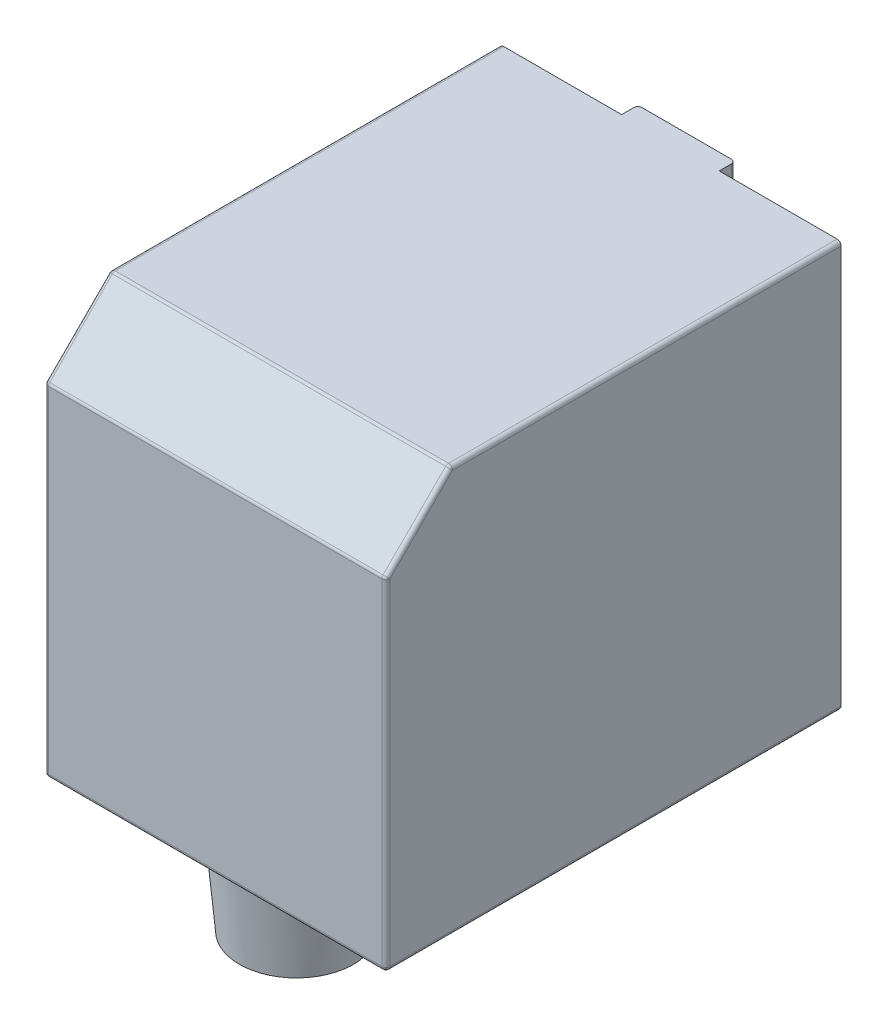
ISO-10303-21;
HEADER;
FILE_DESCRIPTION(('STEP AP214'),'2;1');
FILE_NAME('part.step','',(''),(''),'','','');
FILE_SCHEMA(('AUTOMOTIVE_DESIGN { 1 0 10303 214 1 1 1 1 }'));
ENDSEC;
DATA;
#1=APPLICATION_CONTEXT('core data for automotive mechanical design processes');
#2=APPLICATION_PROTOCOL_DEFINITION('international standard','automotive_design',2000,#1);
#3=PRODUCT_CONTEXT('',#1,'mechanical');
#4=PRODUCT('Part','Part','',(#3));
#5=PRODUCT_RELATED_PRODUCT_CATEGORY('part','',(#4));
#6=PRODUCT_DEFINITION_FORMATION('','',#4);
#7=PRODUCT_DEFINITION_CONTEXT('part definition',#1,'design');
#8=PRODUCT_DEFINITION('design','',#6,#7);
#9=PRODUCT_DEFINITION_SHAPE('','',#8);
#10=(LENGTH_UNIT() NAMED_UNIT(*) SI_UNIT(.MILLI.,.METRE.));
#11=(NAMED_UNIT(*) PLANE_ANGLE_UNIT() SI_UNIT($,.RADIAN.));
#12=(NAMED_UNIT(*) SI_UNIT($,.STERADIAN.) SOLID_ANGLE_UNIT());
#13=UNCERTAINTY_MEASURE_WITH_UNIT(LENGTH_MEASURE(1.E-05),#10,'distance_accuracy_value','');
#14=(GEOMETRIC_REPRESENTATION_CONTEXT(3) GLOBAL_UNCERTAINTY_ASSIGNED_CONTEXT((#13)) GLOBAL_UNIT_ASSIGNED_CONTEXT((#10,
#11,#12)) REPRESENTATION_CONTEXT('',''));
#15=CARTESIAN_POINT('',(0.,0.,0.));
#16=DIRECTION('',(0.,0.,1.));
#17=DIRECTION('',(1.,0.,0.));
#18=AXIS2_PLACEMENT_3D('',#15,#16,#17);
#19=CARTESIAN_POINT('',(0.,500.,0.));
#20=DIRECTION('',(0.,0.,-1.));
#21=DIRECTION('',(-1.,0.,0.));
#22=AXIS2_PLACEMENT_3D('',#19,#20,#21);
#23=PLANE('',#22);
#24=DIRECTION('',(1.,0.,0.));
#25=VECTOR('',#24,1.);
#26=CARTESIAN_POINT('',(0.,5.,0.));
#27=LINE('',#26,#25);
#28=CARTESIAN_POINT('',(420.,5.,0.));
#29=VERTEX_POINT('',#28);
#30=CARTESIAN_POINT('',(270.,5.,0.));
#31=VERTEX_POINT('',#30);
#32=EDGE_CURVE('E184',#29,#31,#27,.F.);
#33=ORIENTED_EDGE('',*,*,#32,.T.);
#34=DIRECTION('',(0.,-1.,0.));
#35=VECTOR('',#34,1.);
#36=CARTESIAN_POINT('',(270.,500.,0.));
#37=LINE('',#36,#35);
#38=CARTESIAN_POINT('',(270.,500.,0.));
#39=VERTEX_POINT('',#38);
#40=EDGE_CURVE('E195',#39,#31,#37,.T.);
#41=ORIENTED_EDGE('',*,*,#40,.F.);
#42=DIRECTION('',(-1.,0.,0.));
#43=VECTOR('',#42,1.);
#44=CARTESIAN_POINT('',(0.,500.,0.));
#45=LINE('',#44,#43);
#46=CARTESIAN_POINT('',(415.,500.,0.));
#47=VERTEX_POINT('',#46);
#48=EDGE_CURVE('E284',#47,#39,#45,.T.);
#49=ORIENTED_EDGE('',*,*,#48,.F.);
#50=CARTESIAN_POINT('',(415.,495.,0.));
#51=DIRECTION('',(0.,0.,-1.));
#52=DIRECTION('',(-1.,0.,0.));
#53=AXIS2_PLACEMENT_3D('',#50,#51,#52);
#54=CIRCLE('',#53,5.);
#55=CARTESIAN_POINT('',(420.,495.,0.));
#56=VERTEX_POINT('',#55);
#57=EDGE_CURVE('E185',#47,#56,#54,.T.);
#58=ORIENTED_EDGE('',*,*,#57,.T.);
#59=DIRECTION('',(0.,1.,0.));
#60=VECTOR('',#59,1.);
#61=CARTESIAN_POINT('',(420.,0.,0.));
#62=LINE('',#61,#60);
#63=EDGE_CURVE('E281',#29,#56,#62,.T.);
#64=ORIENTED_EDGE('',*,*,#63,.F.);
#65=EDGE_LOOP('',(#33,#41,#49,#58,#64));
#66=FACE_BOUND('',#65,.T.);
#67=ADVANCED_FACE('F27',(#66),#23,.T.);
#68=CARTESIAN_POINT('',(150.,500.,0.));
#69=VERTEX_POINT('',#68);
#70=CARTESIAN_POINT('',(5.,500.,0.));
#71=VERTEX_POINT('',#70);
#72=EDGE_CURVE('E190',#69,#71,#45,.T.);
#73=ORIENTED_EDGE('',*,*,#72,.F.);
#74=DIRECTION('',(0.,1.,0.));
#75=VECTOR('',#74,1.);
#76=CARTESIAN_POINT('',(150.,500.,0.));
#77=LINE('',#76,#75);
#78=CARTESIAN_POINT('',(150.,5.,0.));
#79=VERTEX_POINT('',#78);
#80=EDGE_CURVE('E162',#79,#69,#77,.T.);
#81=ORIENTED_EDGE('',*,*,#80,.F.);
#82=CARTESIAN_POINT('',(0.,5.,0.));
#83=VERTEX_POINT('',#82);
#84=EDGE_CURVE('E173',#79,#83,#27,.F.);
#85=ORIENTED_EDGE('',*,*,#84,.T.);
#86=DIRECTION('',(0.,-1.,0.));
#87=VECTOR('',#86,1.);
#88=CARTESIAN_POINT('',(0.,0.,0.));
#89=LINE('',#88,#87);
#90=CARTESIAN_POINT('',(0.,495.,0.));
#91=VERTEX_POINT('',#90);
#92=EDGE_CURVE('E279',#91,#83,#89,.T.);
#93=ORIENTED_EDGE('',*,*,#92,.F.);
#94=CARTESIAN_POINT('',(5.,495.,0.));
#95=DIRECTION('',(0.,0.,-1.));
#96=DIRECTION('',(-1.,0.,0.));
#97=AXIS2_PLACEMENT_3D('',#94,#95,#96);
#98=CIRCLE('',#97,5.);
#99=EDGE_CURVE('E308',#91,#71,#98,.T.);
#100=ORIENTED_EDGE('',*,*,#99,.T.);
#101=EDGE_LOOP('',(#73,#81,#85,#93,#100));
#102=FACE_BOUND('',#101,.T.);
#103=ADVANCED_FACE('F188',(#102),#23,.T.);
#104=CARTESIAN_POINT('',(210.,-110.,460.));
#105=DIRECTION('',(0.,-1.,0.));
#106=DIRECTION('',(0.,0.,-1.));
#107=AXIS2_PLACEMENT_3D('',#104,#105,#106);
#108=PLANE('',#107);
#109=CARTESIAN_POINT('',(210.,-110.,460.));
#110=DIRECTION('',(0.,-1.,0.));
#111=DIRECTION('',(0.,0.,-1.));
#112=AXIS2_PLACEMENT_3D('',#109,#110,#111);
#113=CIRCLE('',#112,70.3762470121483);
#114=CARTESIAN_POINT('',(210.,-110.,389.623752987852));
#115=VERTEX_POINT('',#114);
#116=EDGE_CURVE('E276',#115,#115,#113,.T.);
#117=ORIENTED_EDGE('',*,*,#116,.T.);
#118=EDGE_LOOP('',(#117));
#119=FACE_BOUND('',#118,.T.);
#120=CARTESIAN_POINT('',(210.,-110.,460.));
#121=DIRECTION('',(0.,-1.,0.));
#122=DIRECTION('',(0.,0.,-1.));
#123=AXIS2_PLACEMENT_3D('',#120,#121,#122);
#124=CIRCLE('',#123,42.5);
#125=CARTESIAN_POINT('',(210.,-110.,417.5));
#126=VERTEX_POINT('',#125);
#127=EDGE_CURVE('E270',#126,#126,#124,.T.);
#128=ORIENTED_EDGE('',*,*,#127,.F.);
#129=EDGE_LOOP('',(#128));
#130=FACE_BOUND('',#129,.T.);
#131=ADVANCED_FACE('F461',(#119,#130),#108,.T.);
#132=CARTESIAN_POINT('',(0.,0.,560.));
#133=DIRECTION('',(0.,1.,0.));
#134=DIRECTION('',(0.,0.,1.));
#135=AXIS2_PLACEMENT_3D('',#132,#133,#134);
#136=PLANE('',#135);
#137=DIRECTION('',(1.,0.,0.));
#138=VECTOR('',#137,1.);
#139=CARTESIAN_POINT('',(420.,0.,5.));
#140=LINE('',#139,#138);
#141=CARTESIAN_POINT('',(5.,0.,5.));
#142=VERTEX_POINT('',#141);
#143=CARTESIAN_POINT('',(415.,0.,5.));
#144=VERTEX_POINT('',#143);
#145=EDGE_CURVE('E303',#142,#144,#140,.T.);
#146=ORIENTED_EDGE('',*,*,#145,.T.);
#147=DIRECTION('',(0.,0.,-1.));
#148=VECTOR('',#147,1.);
#149=CARTESIAN_POINT('',(415.,0.,560.));
#150=LINE('',#149,#148);
#151=CARTESIAN_POINT('',(415.,0.,555.));
#152=VERTEX_POINT('',#151);
#153=EDGE_CURVE('E305',#144,#152,#150,.F.);
#154=ORIENTED_EDGE('',*,*,#153,.T.);
#155=DIRECTION('',(1.,0.,0.));
#156=VECTOR('',#155,1.);
#157=CARTESIAN_POINT('',(0.,0.,555.));
#158=LINE('',#157,#156);
#159=CARTESIAN_POINT('',(5.,0.,555.));
#160=VERTEX_POINT('',#159);
#161=EDGE_CURVE('E299',#152,#160,#158,.F.);
#162=ORIENTED_EDGE('',*,*,#161,.T.);
#163=DIRECTION('',(0.,0.,-1.));
#164=VECTOR('',#163,1.);
#165=CARTESIAN_POINT('',(5.,0.,560.));
#166=LINE('',#165,#164);
#167=EDGE_CURVE('E301',#160,#142,#166,.T.);
#168=ORIENTED_EDGE('',*,*,#167,.T.);
#169=EDGE_LOOP('',(#146,#154,#162,#168));
#170=FACE_BOUND('',#169,.T.);
#171=CARTESIAN_POINT('',(210.,0.,460.));
#172=DIRECTION('',(0.,1.,0.));
#173=DIRECTION('',(0.,0.,1.));
#174=AXIS2_PLACEMENT_3D('',#171,#172,#173);
#175=CIRCLE('',#174,80.);
#176=CARTESIAN_POINT('',(210.,0.,540.));
#177=VERTEX_POINT('',#176);
#178=EDGE_CURVE('E287',#177,#177,#175,.F.);
#179=ORIENTED_EDGE('',*,*,#178,.F.);
#180=EDGE_LOOP('',(#179));
#181=FACE_BOUND('',#180,.T.);
#182=ADVANCED_FACE('F398',(#170,#181),#136,.F.);
#183=CARTESIAN_POINT('',(0.,0.,560.));
#184=DIRECTION('',(1.,0.,0.));
#185=DIRECTION('',(0.,0.,-1.));
#186=AXIS2_PLACEMENT_3D('',#183,#184,#185);
#187=PLANE('',#186);
#188=ORIENTED_EDGE('',*,*,#92,.T.);
#189=DIRECTION('',(0.,0.,-1.));
#190=VECTOR('',#189,1.);
#191=CARTESIAN_POINT('',(0.,5.,560.));
#192=LINE('',#191,#190);
#193=CARTESIAN_POINT('',(0.,5.,555.));
#194=VERTEX_POINT('',#193);
#195=EDGE_CURVE('E317',#83,#194,#192,.F.);
#196=ORIENTED_EDGE('',*,*,#195,.T.);
#197=DIRECTION('',(0.,-1.,0.));
#198=VECTOR('',#197,1.);
#199=CARTESIAN_POINT('',(0.,0.,555.));
#200=LINE('',#199,#198);
#201=CARTESIAN_POINT('',(0.,417.928932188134,555.));
#202=VERTEX_POINT('',#201);
#203=EDGE_CURVE('E315',#194,#202,#200,.F.);
#204=ORIENTED_EDGE('',*,*,#203,.T.);
#205=DIRECTION('',(0.,-0.707106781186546,0.707106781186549));
#206=VECTOR('',#205,1.);
#207=CARTESIAN_POINT('',(0.,496.464466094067,476.464466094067));
#208=LINE('',#207,#206);
#209=CARTESIAN_POINT('',(0.,495.,477.928932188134));
#210=VERTEX_POINT('',#209);
#211=EDGE_CURVE('E313',#202,#210,#208,.F.);
#212=ORIENTED_EDGE('',*,*,#211,.T.);
#213=DIRECTION('',(0.,0.,-1.));
#214=VECTOR('',#213,1.);
#215=CARTESIAN_POINT('',(0.,495.,560.));
#216=LINE('',#215,#214);
#217=EDGE_CURVE('E311',#210,#91,#216,.T.);
#218=ORIENTED_EDGE('',*,*,#217,.T.);
#219=EDGE_LOOP('',(#188,#196,#204,#212,#218));
#220=FACE_BOUND('',#219,.T.);
#221=ADVANCED_FACE('F29',(#220),#187,.F.);
#222=CARTESIAN_POINT('',(420.,0.,560.));
#223=DIRECTION('',(-1.,0.,0.));
#224=DIRECTION('',(0.,0.,1.));
#225=AXIS2_PLACEMENT_3D('',#222,#223,#224);
#226=PLANE('',#225);
#227=DIRECTION('',(0.,1.,0.));
#228=VECTOR('',#227,1.);
#229=CARTESIAN_POINT('',(420.,0.,555.));
#230=LINE('',#229,#228);
#231=CARTESIAN_POINT('',(420.,417.928932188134,555.));
#232=VERTEX_POINT('',#231);
#233=CARTESIAN_POINT('',(420.,5.,555.));
#234=VERTEX_POINT('',#233);
#235=EDGE_CURVE('E294',#232,#234,#230,.F.);
#236=ORIENTED_EDGE('',*,*,#235,.T.);
#237=DIRECTION('',(0.,0.,-1.));
#238=VECTOR('',#237,1.);
#239=CARTESIAN_POINT('',(420.,5.,560.));
#240=LINE('',#239,#238);
#241=EDGE_CURVE('E296',#234,#29,#240,.T.);
#242=ORIENTED_EDGE('',*,*,#241,.T.);
#243=ORIENTED_EDGE('',*,*,#63,.T.);
#244=DIRECTION('',(0.,0.,-1.));
#245=VECTOR('',#244,1.);
#246=CARTESIAN_POINT('',(420.,495.,560.));
#247=LINE('',#246,#245);
#248=CARTESIAN_POINT('',(420.,495.,477.928932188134));
#249=VERTEX_POINT('',#248);
#250=EDGE_CURVE('E290',#56,#249,#247,.F.);
#251=ORIENTED_EDGE('',*,*,#250,.T.);
#252=DIRECTION('',(0.,0.707106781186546,-0.707106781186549));
#253=VECTOR('',#252,1.);
#254=CARTESIAN_POINT('',(420.,416.464466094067,556.464466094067));
#255=LINE('',#254,#253);
#256=EDGE_CURVE('E292',#249,#232,#255,.F.);
#257=ORIENTED_EDGE('',*,*,#256,.T.);
#258=EDGE_LOOP('',(#236,#242,#243,#251,#257));
#259=FACE_BOUND('',#258,.T.);
#260=ADVANCED_FACE('F388',(#259),#226,.F.);
#261=CARTESIAN_POINT('',(0.,500.,560.));
#262=DIRECTION('',(0.,-1.,0.));
#263=DIRECTION('',(0.,0.,-1.));
#264=AXIS2_PLACEMENT_3D('',#261,#262,#263);
#265=PLANE('',#264);
#266=DIRECTION('',(0.,0.,1.));
#267=VECTOR('',#266,1.);
#268=CARTESIAN_POINT('',(270.,500.,-20.));
#269=LINE('',#268,#267);
#270=CARTESIAN_POINT('',(270.,500.,-15.));
#271=VERTEX_POINT('',#270);
#272=EDGE_CURVE('E205',#271,#39,#269,.T.);
#273=ORIENTED_EDGE('',*,*,#272,.F.);
#274=CARTESIAN_POINT('',(265.,500.,-15.));
#275=DIRECTION('',(0.,-1.,0.));
#276=DIRECTION('',(0.,0.,-1.));
#277=AXIS2_PLACEMENT_3D('',#274,#275,#276);
#278=CIRCLE('',#277,5.);
#279=CARTESIAN_POINT('',(265.,500.,-20.));
#280=VERTEX_POINT('',#279);
#281=EDGE_CURVE('E35',#271,#280,#278,.F.);
#282=ORIENTED_EDGE('',*,*,#281,.T.);
#283=DIRECTION('',(1.,0.,0.));
#284=VECTOR('',#283,1.);
#285=CARTESIAN_POINT('',(270.,500.,-20.));
#286=LINE('',#285,#284);
#287=CARTESIAN_POINT('',(155.,500.,-20.));
#288=VERTEX_POINT('',#287);
#289=EDGE_CURVE('E202',#288,#280,#286,.T.);
#290=ORIENTED_EDGE('',*,*,#289,.F.);
#291=CARTESIAN_POINT('',(155.,500.,-15.));
#292=DIRECTION('',(0.,-1.,0.));
#293=DIRECTION('',(0.,0.,-1.));
#294=AXIS2_PLACEMENT_3D('',#291,#292,#293);
#295=CIRCLE('',#294,5.);
#296=CARTESIAN_POINT('',(150.,500.,-15.));
#297=VERTEX_POINT('',#296);
#298=EDGE_CURVE('E42',#288,#297,#295,.F.);
#299=ORIENTED_EDGE('',*,*,#298,.T.);
#300=DIRECTION('',(0.,0.,1.));
#301=VECTOR('',#300,1.);
#302=CARTESIAN_POINT('',(150.,500.,-20.));
#303=LINE('',#302,#301);
#304=EDGE_CURVE('E168',#297,#69,#303,.T.);
#305=ORIENTED_EDGE('',*,*,#304,.T.);
#306=ORIENTED_EDGE('',*,*,#72,.T.);
#307=DIRECTION('',(0.,0.,-1.));
#308=VECTOR('',#307,1.);
#309=CARTESIAN_POINT('',(5.,500.,560.));
#310=LINE('',#309,#308);
#311=CARTESIAN_POINT('',(5.,500.,477.928932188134));
#312=VERTEX_POINT('',#311);
#313=EDGE_CURVE('E337',#71,#312,#310,.F.);
#314=ORIENTED_EDGE('',*,*,#313,.T.);
#315=DIRECTION('',(-1.,0.,0.));
#316=VECTOR('',#315,1.);
#317=CARTESIAN_POINT('',(420.,500.,477.928932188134));
#318=LINE('',#317,#316);
#319=CARTESIAN_POINT('',(415.,500.,477.928932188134));
#320=VERTEX_POINT('',#319);
#321=EDGE_CURVE('E339',#312,#320,#318,.F.);
#322=ORIENTED_EDGE('',*,*,#321,.T.);
#323=DIRECTION('',(0.,0.,-1.));
#324=VECTOR('',#323,1.);
#325=CARTESIAN_POINT('',(415.,500.,560.));
#326=LINE('',#325,#324);
#327=EDGE_CURVE('E341',#320,#47,#326,.T.);
#328=ORIENTED_EDGE('',*,*,#327,.T.);
#329=ORIENTED_EDGE('',*,*,#48,.T.);
#330=EDGE_LOOP('',(#273,#282,#290,#299,#305,#306,#314,#322,#328,#329));
#331=FACE_BOUND('',#330,.T.);
#332=ADVANCED_FACE('F355',(#331),#265,.F.);
#333=CARTESIAN_POINT('',(0.,500.,560.));
#334=DIRECTION('',(0.,0.,-1.));
#335=DIRECTION('',(-1.,0.,0.));
#336=AXIS2_PLACEMENT_3D('',#333,#334,#335);
#337=PLANE('',#336);
#338=DIRECTION('',(0.,-1.,0.));
#339=VECTOR('',#338,1.);
#340=CARTESIAN_POINT('',(5.,500.,560.));
#341=LINE('',#340,#339);
#342=CARTESIAN_POINT('',(5.,417.928932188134,560.));
#343=VERTEX_POINT('',#342);
#344=CARTESIAN_POINT('',(5.,5.,560.));
#345=VERTEX_POINT('',#344);
#346=EDGE_CURVE('E321',#343,#345,#341,.T.);
#347=ORIENTED_EDGE('',*,*,#346,.T.);
#348=DIRECTION('',(1.,0.,0.));
#349=VECTOR('',#348,1.);
#350=CARTESIAN_POINT('',(0.,5.,560.));
#351=LINE('',#350,#349);
#352=CARTESIAN_POINT('',(415.,5.,560.));
#353=VERTEX_POINT('',#352);
#354=EDGE_CURVE('E325',#345,#353,#351,.T.);
#355=ORIENTED_EDGE('',*,*,#354,.T.);
#356=DIRECTION('',(0.,1.,0.));
#357=VECTOR('',#356,1.);
#358=CARTESIAN_POINT('',(415.,500.,560.));
#359=LINE('',#358,#357);
#360=CARTESIAN_POINT('',(415.,417.928932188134,560.));
#361=VERTEX_POINT('',#360);
#362=EDGE_CURVE('E323',#353,#361,#359,.T.);
#363=ORIENTED_EDGE('',*,*,#362,.T.);
#364=DIRECTION('',(1.,0.,0.));
#365=VECTOR('',#364,1.);
#366=CARTESIAN_POINT('',(0.,417.928932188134,560.));
#367=LINE('',#366,#365);
#368=EDGE_CURVE('E319',#361,#343,#367,.F.);
#369=ORIENTED_EDGE('',*,*,#368,.T.);
#370=EDGE_LOOP('',(#347,#355,#363,#369));
#371=FACE_BOUND('',#370,.T.);
#372=ADVANCED_FACE('F423',(#371),#337,.F.);
#373=CARTESIAN_POINT('',(0.,420.,560.));
#374=DIRECTION('',(0.,-0.707106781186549,-0.707106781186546));
#375=DIRECTION('',(0.,0.707106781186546,-0.707106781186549));
#376=AXIS2_PLACEMENT_3D('',#373,#374,#375);
#377=PLANE('',#376);
#378=DIRECTION('',(1.,0.,0.));
#379=VECTOR('',#378,1.);
#380=CARTESIAN_POINT('',(0.,498.535533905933,481.464466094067));
#381=LINE('',#380,#379);
#382=CARTESIAN_POINT('',(415.,498.535533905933,481.464466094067));
#383=VERTEX_POINT('',#382);
#384=CARTESIAN_POINT('',(5.,498.535533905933,481.464466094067));
#385=VERTEX_POINT('',#384);
#386=EDGE_CURVE('E328',#383,#385,#381,.F.);
#387=ORIENTED_EDGE('',*,*,#386,.T.);
#388=DIRECTION('',(0.,0.707106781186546,-0.707106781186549));
#389=VECTOR('',#388,1.);
#390=CARTESIAN_POINT('',(5.,420.,560.));
#391=LINE('',#390,#389);
#392=CARTESIAN_POINT('',(5.,421.464466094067,558.535533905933));
#393=VERTEX_POINT('',#392);
#394=EDGE_CURVE('E334',#385,#393,#391,.F.);
#395=ORIENTED_EDGE('',*,*,#394,.T.);
#396=DIRECTION('',(-1.,0.,0.));
#397=VECTOR('',#396,1.);
#398=CARTESIAN_POINT('',(420.,421.464466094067,558.535533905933));
#399=LINE('',#398,#397);
#400=CARTESIAN_POINT('',(415.,421.464466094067,558.535533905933));
#401=VERTEX_POINT('',#400);
#402=EDGE_CURVE('E332',#393,#401,#399,.F.);
#403=ORIENTED_EDGE('',*,*,#402,.T.);
#404=DIRECTION('',(0.,-0.707106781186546,0.707106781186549));
#405=VECTOR('',#404,1.);
#406=CARTESIAN_POINT('',(415.,500.,480.));
#407=LINE('',#406,#405);
#408=EDGE_CURVE('E330',#401,#383,#407,.F.);
#409=ORIENTED_EDGE('',*,*,#408,.T.);
#410=EDGE_LOOP('',(#387,#395,#403,#409));
#411=FACE_BOUND('',#410,.T.);
#412=ADVANCED_FACE('F436',(#411),#377,.F.);
#413=CARTESIAN_POINT('',(210.,0.,460.));
#414=DIRECTION('',(0.,1.,0.));
#415=DIRECTION('',(0.,0.,-1.));
#416=AXIS2_PLACEMENT_3D('',#413,#414,#415);
#417=CONICAL_SURFACE('',#416,80.,0.0872664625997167);
#418=ORIENTED_EDGE('',*,*,#116,.F.);
#419=EDGE_LOOP('',(#418));
#420=FACE_BOUND('',#419,.T.);
#421=ORIENTED_EDGE('',*,*,#178,.T.);
#422=EDGE_LOOP('',(#421));
#423=FACE_BOUND('',#422,.T.);
#424=ADVANCED_FACE('F485',(#420,#423),#417,.T.);
#425=CARTESIAN_POINT('',(210.,-120.,460.));
#426=DIRECTION('',(0.,1.,0.));
#427=DIRECTION('',(0.,0.,1.));
#428=AXIS2_PLACEMENT_3D('',#425,#426,#427);
#429=CYLINDRICAL_SURFACE('',#428,42.5);
#430=CARTESIAN_POINT('',(210.,-120.,460.));
#431=DIRECTION('',(0.,-1.,0.));
#432=DIRECTION('',(0.,0.,-1.));
#433=AXIS2_PLACEMENT_3D('',#430,#431,#432);
#434=CIRCLE('',#433,42.5);
#435=CARTESIAN_POINT('',(210.,-120.,417.5));
#436=VERTEX_POINT('',#435);
#437=EDGE_CURVE('E273',#436,#436,#434,.T.);
#438=ORIENTED_EDGE('',*,*,#437,.F.);
#439=EDGE_LOOP('',(#438));
#440=FACE_BOUND('',#439,.T.);
#441=ORIENTED_EDGE('',*,*,#127,.T.);
#442=EDGE_LOOP('',(#441));
#443=FACE_BOUND('',#442,.T.);
#444=ADVANCED_FACE('F483',(#440,#443),#429,.T.);
#445=CARTESIAN_POINT('',(210.,-120.,460.));
#446=DIRECTION('',(0.,-1.,0.));
#447=DIRECTION('',(0.,0.,-1.));
#448=AXIS2_PLACEMENT_3D('',#445,#446,#447);
#449=PLANE('',#448);
#450=CARTESIAN_POINT('',(210.,-120.,460.));
#451=DIRECTION('',(0.,-1.,0.));
#452=DIRECTION('',(0.,0.,-1.));
#453=AXIS2_PLACEMENT_3D('',#450,#451,#452);
#454=CIRCLE('',#453,22.5);
#455=CARTESIAN_POINT('',(210.,-120.,437.5));
#456=VERTEX_POINT('',#455);
#457=EDGE_CURVE('E209',#456,#456,#454,.T.);
#458=ORIENTED_EDGE('',*,*,#457,.F.);
#459=EDGE_LOOP('',(#458));
#460=FACE_BOUND('',#459,.T.);
#461=ORIENTED_EDGE('',*,*,#437,.T.);
#462=EDGE_LOOP('',(#461));
#463=FACE_BOUND('',#462,.T.);
#464=ADVANCED_FACE('F489',(#460,#463),#449,.T.);
#465=CARTESIAN_POINT('',(5.,495.,560.));
#466=DIRECTION('',(0.,0.,-1.));
#467=DIRECTION('',(-1.,0.,0.));
#468=AXIS2_PLACEMENT_3D('',#465,#466,#467);
#469=CYLINDRICAL_SURFACE('',#468,5.);
#470=CARTESIAN_POINT('',(5.,495.,477.928932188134));
#471=DIRECTION('',(0.,0.,1.));
#472=DIRECTION('',(1.,0.,0.));
#473=AXIS2_PLACEMENT_3D('',#470,#471,#472);
#474=CIRCLE('',#473,5.);
#475=EDGE_CURVE('E267',#312,#210,#474,.T.);
#476=ORIENTED_EDGE('',*,*,#475,.F.);
#477=ORIENTED_EDGE('',*,*,#313,.F.);
#478=ORIENTED_EDGE('',*,*,#99,.F.);
#479=ORIENTED_EDGE('',*,*,#217,.F.);
#480=EDGE_LOOP('',(#476,#477,#478,#479));
#481=FACE_BOUND('',#480,.T.);
#482=ADVANCED_FACE('F445',(#481),#469,.T.);
#483=CARTESIAN_POINT('',(5.,495.,477.928932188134));
#484=DIRECTION('',(0.,0.,1.));
#485=DIRECTION('',(1.,0.,0.));
#486=AXIS2_PLACEMENT_3D('',#483,#484,#485);
#487=SPHERICAL_SURFACE('',#486,5.);
#488=CARTESIAN_POINT('',(5.,495.,477.928932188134));
#489=DIRECTION('',(0.,0.707106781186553,-0.707106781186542));
#490=DIRECTION('',(0.,0.707106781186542,0.707106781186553));
#491=AXIS2_PLACEMENT_3D('',#488,#489,#490);
#492=CIRCLE('',#491,5.);
#493=EDGE_CURVE('E261',#385,#210,#492,.F.);
#494=ORIENTED_EDGE('',*,*,#493,.F.);
#495=CARTESIAN_POINT('',(5.,495.,477.928932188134));
#496=DIRECTION('',(-1.,0.,0.));
#497=DIRECTION('',(0.,0.,1.));
#498=AXIS2_PLACEMENT_3D('',#495,#496,#497);
#499=CIRCLE('',#498,5.);
#500=EDGE_CURVE('E264',#312,#385,#499,.F.);
#501=ORIENTED_EDGE('',*,*,#500,.F.);
#502=ORIENTED_EDGE('',*,*,#475,.T.);
#503=EDGE_LOOP('',(#494,#501,#502));
#504=FACE_BOUND('',#503,.T.);
#505=ADVANCED_FACE('F440',(#504),#487,.T.);
#506=CARTESIAN_POINT('',(0.,495.,477.928932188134));
#507=DIRECTION('',(1.,0.,0.));
#508=DIRECTION('',(0.,0.,-1.));
#509=AXIS2_PLACEMENT_3D('',#506,#507,#508);
#510=CYLINDRICAL_SURFACE('',#509,5.);
#511=ORIENTED_EDGE('',*,*,#500,.T.);
#512=ORIENTED_EDGE('',*,*,#386,.F.);
#513=CARTESIAN_POINT('',(415.,495.,477.928932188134));
#514=DIRECTION('',(1.,0.,0.));
#515=DIRECTION('',(0.,0.,-1.));
#516=AXIS2_PLACEMENT_3D('',#513,#514,#515);
#517=CIRCLE('',#516,5.);
#518=EDGE_CURVE('E258',#320,#383,#517,.T.);
#519=ORIENTED_EDGE('',*,*,#518,.F.);
#520=ORIENTED_EDGE('',*,*,#321,.F.);
#521=EDGE_LOOP('',(#511,#512,#519,#520));
#522=FACE_BOUND('',#521,.T.);
#523=ADVANCED_FACE('F378',(#522),#510,.T.);
#524=CARTESIAN_POINT('',(415.,495.,560.));
#525=DIRECTION('',(0.,0.,-1.));
#526=DIRECTION('',(-1.,0.,0.));
#527=AXIS2_PLACEMENT_3D('',#524,#525,#526);
#528=CYLINDRICAL_SURFACE('',#527,5.);
#529=ORIENTED_EDGE('',*,*,#57,.F.);
#530=ORIENTED_EDGE('',*,*,#327,.F.);
#531=CARTESIAN_POINT('',(415.,495.,477.928932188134));
#532=DIRECTION('',(0.,0.,1.));
#533=DIRECTION('',(0.,-1.,0.));
#534=AXIS2_PLACEMENT_3D('',#531,#532,#533);
#535=CIRCLE('',#534,5.);
#536=EDGE_CURVE('E255',#249,#320,#535,.T.);
#537=ORIENTED_EDGE('',*,*,#536,.F.);
#538=ORIENTED_EDGE('',*,*,#250,.F.);
#539=EDGE_LOOP('',(#529,#530,#537,#538));
#540=FACE_BOUND('',#539,.T.);
#541=ADVANCED_FACE('F373',(#540),#528,.T.);
#542=CARTESIAN_POINT('',(5.,206.464466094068,766.464466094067));
#543=DIRECTION('',(0.,0.707106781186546,-0.707106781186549));
#544=DIRECTION('',(0.,0.707106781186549,0.707106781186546));
#545=AXIS2_PLACEMENT_3D('',#542,#543,#544);
#546=CYLINDRICAL_SURFACE('',#545,5.);
#547=ORIENTED_EDGE('',*,*,#493,.T.);
#548=ORIENTED_EDGE('',*,*,#211,.F.);
#549=CARTESIAN_POINT('',(5.,417.928932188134,555.));
#550=DIRECTION('',(0.,-0.707106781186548,0.707106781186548));
#551=DIRECTION('',(0.,-0.707106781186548,-0.707106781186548));
#552=AXIS2_PLACEMENT_3D('',#549,#550,#551);
#553=CIRCLE('',#552,5.);
#554=EDGE_CURVE('E252',#393,#202,#553,.T.);
#555=ORIENTED_EDGE('',*,*,#554,.F.);
#556=ORIENTED_EDGE('',*,*,#394,.F.);
#557=EDGE_LOOP('',(#547,#548,#555,#556));
#558=FACE_BOUND('',#557,.T.);
#559=ADVANCED_FACE('F434',(#558),#546,.T.);
#560=CARTESIAN_POINT('',(415.,495.,477.928932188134));
#561=DIRECTION('',(0.,0.,1.));
#562=DIRECTION('',(1.,0.,0.));
#563=AXIS2_PLACEMENT_3D('',#560,#561,#562);
#564=SPHERICAL_SURFACE('',#563,5.);
#565=ORIENTED_EDGE('',*,*,#536,.T.);
#566=ORIENTED_EDGE('',*,*,#518,.T.);
#567=CARTESIAN_POINT('',(415.,495.,477.928932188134));
#568=DIRECTION('',(0.,0.707106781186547,-0.707106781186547));
#569=DIRECTION('',(0.,0.707106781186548,0.707106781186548));
#570=AXIS2_PLACEMENT_3D('',#567,#568,#569);
#571=CIRCLE('',#570,5.);
#572=EDGE_CURVE('E246',#249,#383,#571,.F.);
#573=ORIENTED_EDGE('',*,*,#572,.F.);
#574=EDGE_LOOP('',(#565,#566,#573));
#575=FACE_BOUND('',#574,.T.);
#576=ADVANCED_FACE('F380',(#575),#564,.T.);
#577=CARTESIAN_POINT('',(5.,417.928932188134,555.));
#578=DIRECTION('',(0.,0.,1.));
#579=DIRECTION('',(1.,0.,0.));
#580=AXIS2_PLACEMENT_3D('',#577,#578,#579);
#581=SPHERICAL_SURFACE('',#580,5.);
#582=CARTESIAN_POINT('',(5.,417.928932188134,555.));
#583=DIRECTION('',(0.,1.,0.));
#584=DIRECTION('',(0.,0.,1.));
#585=AXIS2_PLACEMENT_3D('',#582,#583,#584);
#586=CIRCLE('',#585,5.);
#587=EDGE_CURVE('E243',#343,#202,#586,.F.);
#588=ORIENTED_EDGE('',*,*,#587,.F.);
#589=CARTESIAN_POINT('',(5.,417.928932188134,555.));
#590=DIRECTION('',(-1.,0.,0.));
#591=DIRECTION('',(0.,0.,1.));
#592=AXIS2_PLACEMENT_3D('',#589,#590,#591);
#593=CIRCLE('',#592,5.);
#594=EDGE_CURVE('E249',#393,#343,#593,.F.);
#595=ORIENTED_EDGE('',*,*,#594,.F.);
#596=ORIENTED_EDGE('',*,*,#554,.T.);
#597=EDGE_LOOP('',(#588,#595,#596));
#598=FACE_BOUND('',#597,.T.);
#599=ADVANCED_FACE('F431',(#598),#581,.T.);
#600=CARTESIAN_POINT('',(0.,417.928932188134,555.));
#601=DIRECTION('',(-1.,0.,0.));
#602=DIRECTION('',(0.,0.,1.));
#603=AXIS2_PLACEMENT_3D('',#600,#601,#602);
#604=CYLINDRICAL_SURFACE('',#603,5.);
#605=ORIENTED_EDGE('',*,*,#594,.T.);
#606=ORIENTED_EDGE('',*,*,#368,.F.);
#607=CARTESIAN_POINT('',(415.,417.928932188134,555.));
#608=DIRECTION('',(1.,0.,0.));
#609=DIRECTION('',(0.,0.,-1.));
#610=AXIS2_PLACEMENT_3D('',#607,#608,#609);
#611=CIRCLE('',#610,5.);
#612=EDGE_CURVE('E240',#401,#361,#611,.T.);
#613=ORIENTED_EDGE('',*,*,#612,.F.);
#614=ORIENTED_EDGE('',*,*,#402,.F.);
#615=EDGE_LOOP('',(#605,#606,#613,#614));
#616=FACE_BOUND('',#615,.T.);
#617=ADVANCED_FACE('F428',(#616),#604,.T.);
#618=CARTESIAN_POINT('',(415.,206.464466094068,766.464466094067));
#619=DIRECTION('',(0.,-0.707106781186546,0.707106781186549));
#620=DIRECTION('',(0.,-0.707106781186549,-0.707106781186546));
#621=AXIS2_PLACEMENT_3D('',#618,#619,#620);
#622=CYLINDRICAL_SURFACE('',#621,5.);
#623=ORIENTED_EDGE('',*,*,#572,.T.);
#624=ORIENTED_EDGE('',*,*,#408,.F.);
#625=CARTESIAN_POINT('',(415.,417.928932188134,555.));
#626=DIRECTION('',(0.,-0.707106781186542,0.707106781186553));
#627=DIRECTION('',(0.,-0.707106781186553,-0.707106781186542));
#628=AXIS2_PLACEMENT_3D('',#625,#626,#627);
#629=CIRCLE('',#628,5.);
#630=EDGE_CURVE('E237',#232,#401,#629,.T.);
#631=ORIENTED_EDGE('',*,*,#630,.F.);
#632=ORIENTED_EDGE('',*,*,#256,.F.);
#633=EDGE_LOOP('',(#623,#624,#631,#632));
#634=FACE_BOUND('',#633,.T.);
#635=ADVANCED_FACE('F385',(#634),#622,.T.);
#636=CARTESIAN_POINT('',(5.,500.,555.));
#637=DIRECTION('',(0.,-1.,0.));
#638=DIRECTION('',(0.,0.,-1.));
#639=AXIS2_PLACEMENT_3D('',#636,#637,#638);
#640=CYLINDRICAL_SURFACE('',#639,5.);
#641=ORIENTED_EDGE('',*,*,#587,.T.);
#642=ORIENTED_EDGE('',*,*,#203,.F.);
#643=CARTESIAN_POINT('',(5.,5.,555.));
#644=DIRECTION('',(0.,-1.,0.));
#645=DIRECTION('',(1.,0.,0.));
#646=AXIS2_PLACEMENT_3D('',#643,#644,#645);
#647=CIRCLE('',#646,5.);
#648=EDGE_CURVE('E234',#345,#194,#647,.T.);
#649=ORIENTED_EDGE('',*,*,#648,.F.);
#650=ORIENTED_EDGE('',*,*,#346,.F.);
#651=EDGE_LOOP('',(#641,#642,#649,#650));
#652=FACE_BOUND('',#651,.T.);
#653=ADVANCED_FACE('F411',(#652),#640,.T.);
#654=CARTESIAN_POINT('',(415.,417.928932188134,555.));
#655=DIRECTION('',(0.,0.,1.));
#656=DIRECTION('',(1.,0.,0.));
#657=AXIS2_PLACEMENT_3D('',#654,#655,#656);
#658=SPHERICAL_SURFACE('',#657,5.);
#659=ORIENTED_EDGE('',*,*,#630,.T.);
#660=ORIENTED_EDGE('',*,*,#612,.T.);
#661=CARTESIAN_POINT('',(415.,417.928932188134,555.));
#662=DIRECTION('',(0.,1.,0.));
#663=DIRECTION('',(-1.,0.,0.));
#664=AXIS2_PLACEMENT_3D('',#661,#662,#663);
#665=CIRCLE('',#664,5.);
#666=EDGE_CURVE('E228',#232,#361,#665,.F.);
#667=ORIENTED_EDGE('',*,*,#666,.F.);
#668=EDGE_LOOP('',(#659,#660,#667));
#669=FACE_BOUND('',#668,.T.);
#670=ADVANCED_FACE('F560',(#669),#658,.T.);
#671=CARTESIAN_POINT('',(5.,5.,555.));
#672=DIRECTION('',(0.,0.,1.));
#673=DIRECTION('',(1.,0.,0.));
#674=AXIS2_PLACEMENT_3D('',#671,#672,#673);
#675=SPHERICAL_SURFACE('',#674,5.);
#676=CARTESIAN_POINT('',(5.,5.,555.));
#677=DIRECTION('',(0.,0.,1.));
#678=DIRECTION('',(1.,0.,0.));
#679=AXIS2_PLACEMENT_3D('',#676,#677,#678);
#680=CIRCLE('',#679,5.);
#681=EDGE_CURVE('E225',#160,#194,#680,.F.);
#682=ORIENTED_EDGE('',*,*,#681,.F.);
#683=CARTESIAN_POINT('',(5.,5.,555.));
#684=DIRECTION('',(-1.,0.,0.));
#685=DIRECTION('',(0.,0.,1.));
#686=AXIS2_PLACEMENT_3D('',#683,#684,#685);
#687=CIRCLE('',#686,5.);
#688=EDGE_CURVE('E231',#345,#160,#687,.F.);
#689=ORIENTED_EDGE('',*,*,#688,.F.);
#690=ORIENTED_EDGE('',*,*,#648,.T.);
#691=EDGE_LOOP('',(#682,#689,#690));
#692=FACE_BOUND('',#691,.T.);
#693=ADVANCED_FACE('F416',(#692),#675,.T.);
#694=CARTESIAN_POINT('',(0.,5.,555.));
#695=DIRECTION('',(1.,0.,0.));
#696=DIRECTION('',(0.,0.,-1.));
#697=AXIS2_PLACEMENT_3D('',#694,#695,#696);
#698=CYLINDRICAL_SURFACE('',#697,5.);
#699=ORIENTED_EDGE('',*,*,#688,.T.);
#700=ORIENTED_EDGE('',*,*,#161,.F.);
#701=CARTESIAN_POINT('',(415.,5.,555.));
#702=DIRECTION('',(1.,0.,0.));
#703=DIRECTION('',(0.,0.,-1.));
#704=AXIS2_PLACEMENT_3D('',#701,#702,#703);
#705=CIRCLE('',#704,5.);
#706=EDGE_CURVE('E222',#353,#152,#705,.T.);
#707=ORIENTED_EDGE('',*,*,#706,.F.);
#708=ORIENTED_EDGE('',*,*,#354,.F.);
#709=EDGE_LOOP('',(#699,#700,#707,#708));
#710=FACE_BOUND('',#709,.T.);
#711=ADVANCED_FACE('F420',(#710),#698,.T.);
#712=CARTESIAN_POINT('',(415.,500.,555.));
#713=DIRECTION('',(0.,1.,0.));
#714=DIRECTION('',(0.,0.,1.));
#715=AXIS2_PLACEMENT_3D('',#712,#713,#714);
#716=CYLINDRICAL_SURFACE('',#715,5.);
#717=ORIENTED_EDGE('',*,*,#666,.T.);
#718=ORIENTED_EDGE('',*,*,#362,.F.);
#719=CARTESIAN_POINT('',(415.,5.,555.));
#720=DIRECTION('',(0.,-1.,0.));
#721=DIRECTION('',(0.,0.,-1.));
#722=AXIS2_PLACEMENT_3D('',#719,#720,#721);
#723=CIRCLE('',#722,5.);
#724=EDGE_CURVE('E220',#234,#353,#723,.T.);
#725=ORIENTED_EDGE('',*,*,#724,.F.);
#726=ORIENTED_EDGE('',*,*,#235,.F.);
#727=EDGE_LOOP('',(#717,#718,#725,#726));
#728=FACE_BOUND('',#727,.T.);
#729=ADVANCED_FACE('F580',(#728),#716,.T.);
#730=CARTESIAN_POINT('',(5.,5.,560.));
#731=DIRECTION('',(0.,0.,-1.));
#732=DIRECTION('',(-1.,0.,0.));
#733=AXIS2_PLACEMENT_3D('',#730,#731,#732);
#734=CYLINDRICAL_SURFACE('',#733,5.);
#735=ORIENTED_EDGE('',*,*,#681,.T.);
#736=ORIENTED_EDGE('',*,*,#195,.F.);
#737=CARTESIAN_POINT('',(5.,5.,5.));
#738=DIRECTION('',(0.707106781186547,0.,-0.707106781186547));
#739=DIRECTION('',(-0.707106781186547,0.,-0.707106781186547));
#740=AXIS2_PLACEMENT_3D('',#737,#738,#739);
#741=ELLIPSE('',#740,7.07106781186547,5.);
#742=EDGE_CURVE('E180',#142,#83,#741,.T.);
#743=ORIENTED_EDGE('',*,*,#742,.F.);
#744=ORIENTED_EDGE('',*,*,#167,.F.);
#745=EDGE_LOOP('',(#735,#736,#743,#744));
#746=FACE_BOUND('',#745,.T.);
#747=ADVANCED_FACE('F404',(#746),#734,.T.);
#748=CARTESIAN_POINT('',(415.,5.,555.));
#749=DIRECTION('',(0.,0.,1.));
#750=DIRECTION('',(1.,0.,0.));
#751=AXIS2_PLACEMENT_3D('',#748,#749,#750);
#752=SPHERICAL_SURFACE('',#751,5.);
#753=ORIENTED_EDGE('',*,*,#724,.T.);
#754=ORIENTED_EDGE('',*,*,#706,.T.);
#755=CARTESIAN_POINT('',(415.,5.,555.));
#756=DIRECTION('',(0.,0.,1.));
#757=DIRECTION('',(1.,0.,0.));
#758=AXIS2_PLACEMENT_3D('',#755,#756,#757);
#759=CIRCLE('',#758,5.);
#760=EDGE_CURVE('E217',#234,#152,#759,.F.);
#761=ORIENTED_EDGE('',*,*,#760,.F.);
#762=EDGE_LOOP('',(#753,#754,#761));
#763=FACE_BOUND('',#762,.T.);
#764=ADVANCED_FACE('F594',(#763),#752,.T.);
#765=CARTESIAN_POINT('',(0.,5.,5.));
#766=DIRECTION('',(-1.,0.,0.));
#767=DIRECTION('',(0.,0.,1.));
#768=AXIS2_PLACEMENT_3D('',#765,#766,#767);
#769=CYLINDRICAL_SURFACE('',#768,5.);
#770=ORIENTED_EDGE('',*,*,#742,.T.);
#771=ORIENTED_EDGE('',*,*,#84,.F.);
#772=DIRECTION('',(-1.,0.,0.));
#773=VECTOR('',#772,1.);
#774=CARTESIAN_POINT('',(270.,5.,0.));
#775=LINE('',#774,#773);
#776=EDGE_CURVE('E176',#31,#79,#775,.T.);
#777=ORIENTED_EDGE('',*,*,#776,.F.);
#778=ORIENTED_EDGE('',*,*,#32,.F.);
#779=CARTESIAN_POINT('',(415.,5.,5.));
#780=DIRECTION('',(-0.707106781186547,0.,-0.707106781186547));
#781=DIRECTION('',(-0.707106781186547,0.,0.707106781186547));
#782=AXIS2_PLACEMENT_3D('',#779,#780,#781);
#783=ELLIPSE('',#782,7.07106781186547,5.);
#784=EDGE_CURVE('E215',#144,#29,#783,.F.);
#785=ORIENTED_EDGE('',*,*,#784,.F.);
#786=ORIENTED_EDGE('',*,*,#145,.F.);
#787=EDGE_LOOP('',(#770,#771,#777,#778,#785,#786));
#788=FACE_BOUND('',#787,.T.);
#789=ADVANCED_FACE('F174',(#788),#769,.T.);
#790=CARTESIAN_POINT('',(415.,5.,560.));
#791=DIRECTION('',(0.,0.,-1.));
#792=DIRECTION('',(-1.,0.,0.));
#793=AXIS2_PLACEMENT_3D('',#790,#791,#792);
#794=CYLINDRICAL_SURFACE('',#793,5.);
#795=ORIENTED_EDGE('',*,*,#760,.T.);
#796=ORIENTED_EDGE('',*,*,#153,.F.);
#797=ORIENTED_EDGE('',*,*,#784,.T.);
#798=ORIENTED_EDGE('',*,*,#241,.F.);
#799=EDGE_LOOP('',(#795,#796,#797,#798));
#800=FACE_BOUND('',#799,.T.);
#801=ADVANCED_FACE('F393',(#800),#794,.T.);
#802=CARTESIAN_POINT('',(210.,-120.,460.));
#803=DIRECTION('',(0.,-1.,0.));
#804=DIRECTION('',(0.,0.,-1.));
#805=AXIS2_PLACEMENT_3D('',#802,#803,#804);
#806=CONICAL_SURFACE('',#805,22.5,0.05235987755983);
#807=CARTESIAN_POINT('',(210.,0.,460.));
#808=DIRECTION('',(0.,-1.,0.));
#809=DIRECTION('',(0.,0.,-1.));
#810=AXIS2_PLACEMENT_3D('',#807,#808,#809);
#811=CIRCLE('',#810,16.211066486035);
#812=CARTESIAN_POINT('',(210.,0.,443.788933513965));
#813=VERTEX_POINT('',#812);
#814=EDGE_CURVE('E212',#813,#813,#811,.T.);
#815=ORIENTED_EDGE('',*,*,#814,.F.);
#816=EDGE_LOOP('',(#815));
#817=FACE_BOUND('',#816,.T.);
#818=ORIENTED_EDGE('',*,*,#457,.T.);
#819=EDGE_LOOP('',(#818));
#820=FACE_BOUND('',#819,.T.);
#821=ADVANCED_FACE('F609',(#817,#820),#806,.F.);
#822=CARTESIAN_POINT('',(210.,0.,460.));
#823=DIRECTION('',(0.,-1.,0.));
#824=DIRECTION('',(0.,0.,-1.));
#825=AXIS2_PLACEMENT_3D('',#822,#823,#824);
#826=PLANE('',#825);
#827=ORIENTED_EDGE('',*,*,#814,.T.);
#828=EDGE_LOOP('',(#827));
#829=FACE_BOUND('',#828,.T.);
#830=ADVANCED_FACE('F621',(#829),#826,.T.);
#831=CARTESIAN_POINT('',(270.,500.,-20.));
#832=DIRECTION('',(-1.,0.,0.));
#833=DIRECTION('',(0.,-1.,0.));
#834=AXIS2_PLACEMENT_3D('',#831,#832,#833);
#835=PLANE('',#834);
#836=DIRECTION('',(0.,0.,1.));
#837=VECTOR('',#836,1.);
#838=CARTESIAN_POINT('',(270.,5.,-20.));
#839=LINE('',#838,#837);
#840=CARTESIAN_POINT('',(270.,5.,-15.));
#841=VERTEX_POINT('',#840);
#842=EDGE_CURVE('E167',#841,#31,#839,.T.);
#843=ORIENTED_EDGE('',*,*,#842,.F.);
#844=DIRECTION('',(0.,-1.,0.));
#845=VECTOR('',#844,1.);
#846=CARTESIAN_POINT('',(270.,500.,-15.));
#847=LINE('',#846,#845);
#848=EDGE_CURVE('E50',#841,#271,#847,.F.);
#849=ORIENTED_EDGE('',*,*,#848,.T.);
#850=ORIENTED_EDGE('',*,*,#272,.T.);
#851=ORIENTED_EDGE('',*,*,#40,.T.);
#852=EDGE_LOOP('',(#843,#849,#850,#851));
#853=FACE_BOUND('',#852,.T.);
#854=ADVANCED_FACE('F362',(#853),#835,.F.);
#855=CARTESIAN_POINT('',(270.,5.,-20.));
#856=DIRECTION('',(0.,1.,0.));
#857=DIRECTION('',(0.,0.,1.));
#858=AXIS2_PLACEMENT_3D('',#855,#856,#857);
#859=PLANE('',#858);
#860=DIRECTION('',(-1.,0.,0.));
#861=VECTOR('',#860,1.);
#862=CARTESIAN_POINT('',(270.,5.,-20.));
#863=LINE('',#862,#861);
#864=CARTESIAN_POINT('',(265.,5.,-20.));
#865=VERTEX_POINT('',#864);
#866=CARTESIAN_POINT('',(155.,5.,-20.));
#867=VERTEX_POINT('',#866);
#868=EDGE_CURVE('E191',#865,#867,#863,.T.);
#869=ORIENTED_EDGE('',*,*,#868,.F.);
#870=CARTESIAN_POINT('',(265.,5.,-15.));
#871=DIRECTION('',(0.,1.,0.));
#872=DIRECTION('',(0.,0.,1.));
#873=AXIS2_PLACEMENT_3D('',#870,#871,#872);
#874=CIRCLE('',#873,5.);
#875=EDGE_CURVE('E351',#865,#841,#874,.F.);
#876=ORIENTED_EDGE('',*,*,#875,.T.);
#877=ORIENTED_EDGE('',*,*,#842,.T.);
#878=ORIENTED_EDGE('',*,*,#776,.T.);
#879=DIRECTION('',(0.,0.,1.));
#880=VECTOR('',#879,1.);
#881=CARTESIAN_POINT('',(150.,5.,-20.));
#882=LINE('',#881,#880);
#883=CARTESIAN_POINT('',(150.,5.,-15.));
#884=VERTEX_POINT('',#883);
#885=EDGE_CURVE('E158',#884,#79,#882,.T.);
#886=ORIENTED_EDGE('',*,*,#885,.F.);
#887=CARTESIAN_POINT('',(155.,5.,-15.));
#888=DIRECTION('',(0.,1.,0.));
#889=DIRECTION('',(0.,0.,1.));
#890=AXIS2_PLACEMENT_3D('',#887,#888,#889);
#891=CIRCLE('',#890,5.);
#892=EDGE_CURVE('E349',#884,#867,#891,.F.);
#893=ORIENTED_EDGE('',*,*,#892,.T.);
#894=EDGE_LOOP('',(#869,#876,#877,#878,#886,#893));
#895=FACE_BOUND('',#894,.T.);
#896=ADVANCED_FACE('F194',(#895),#859,.F.);
#897=CARTESIAN_POINT('',(150.,500.,-20.));
#898=DIRECTION('',(1.,0.,0.));
#899=DIRECTION('',(0.,1.,0.));
#900=AXIS2_PLACEMENT_3D('',#897,#898,#899);
#901=PLANE('',#900);
#902=ORIENTED_EDGE('',*,*,#304,.F.);
#903=DIRECTION('',(0.,1.,0.));
#904=VECTOR('',#903,1.);
#905=CARTESIAN_POINT('',(150.,5.,-15.));
#906=LINE('',#905,#904);
#907=EDGE_CURVE('E11',#297,#884,#906,.F.);
#908=ORIENTED_EDGE('',*,*,#907,.T.);
#909=ORIENTED_EDGE('',*,*,#885,.T.);
#910=ORIENTED_EDGE('',*,*,#80,.T.);
#911=EDGE_LOOP('',(#902,#908,#909,#910));
#912=FACE_BOUND('',#911,.T.);
#913=ADVANCED_FACE('F160',(#912),#901,.F.);
#914=CARTESIAN_POINT('',(270.,5.,-20.));
#915=DIRECTION('',(0.,0.,-1.));
#916=DIRECTION('',(-1.,0.,0.));
#917=AXIS2_PLACEMENT_3D('',#914,#915,#916);
#918=PLANE('',#917);
#919=ORIENTED_EDGE('',*,*,#289,.T.);
#920=DIRECTION('',(0.,-1.,0.));
#921=VECTOR('',#920,1.);
#922=CARTESIAN_POINT('',(265.,5.,-20.));
#923=LINE('',#922,#921);
#924=EDGE_CURVE('E346',#280,#865,#923,.T.);
#925=ORIENTED_EDGE('',*,*,#924,.T.);
#926=ORIENTED_EDGE('',*,*,#868,.T.);
#927=DIRECTION('',(0.,1.,0.));
#928=VECTOR('',#927,1.);
#929=CARTESIAN_POINT('',(155.,500.,-20.));
#930=LINE('',#929,#928);
#931=EDGE_CURVE('E343',#867,#288,#930,.T.);
#932=ORIENTED_EDGE('',*,*,#931,.T.);
#933=EDGE_LOOP('',(#919,#925,#926,#932));
#934=FACE_BOUND('',#933,.T.);
#935=ADVANCED_FACE('F359',(#934),#918,.T.);
#936=CARTESIAN_POINT('',(265.,5.,-15.));
#937=DIRECTION('',(0.,1.,0.));
#938=DIRECTION('',(-1.,0.,0.));
#939=AXIS2_PLACEMENT_3D('',#936,#937,#938);
#940=CYLINDRICAL_SURFACE('',#939,5.);
#941=ORIENTED_EDGE('',*,*,#281,.F.);
#942=ORIENTED_EDGE('',*,*,#848,.F.);
#943=ORIENTED_EDGE('',*,*,#875,.F.);
#944=ORIENTED_EDGE('',*,*,#924,.F.);
#945=EDGE_LOOP('',(#941,#942,#943,#944));
#946=FACE_BOUND('',#945,.T.);
#947=ADVANCED_FACE('F361',(#946),#940,.T.);
#948=CARTESIAN_POINT('',(155.,5.00000000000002,-15.));
#949=DIRECTION('',(0.,-1.,0.));
#950=DIRECTION('',(1.,0.,0.));
#951=AXIS2_PLACEMENT_3D('',#948,#949,#950);
#952=CYLINDRICAL_SURFACE('',#951,5.);
#953=ORIENTED_EDGE('',*,*,#892,.F.);
#954=ORIENTED_EDGE('',*,*,#907,.F.);
#955=ORIENTED_EDGE('',*,*,#298,.F.);
#956=ORIENTED_EDGE('',*,*,#931,.F.);
#957=EDGE_LOOP('',(#953,#954,#955,#956));
#958=FACE_BOUND('',#957,.T.);
#959=ADVANCED_FACE('F448',(#958),#952,.T.);
#960=CLOSED_SHELL('',(#67,#103,#131,#182,#221,#260,#332,#372,#412,#424,#444,#464,#482,#505,#523,
#541,#559,#576,#599,#617,#635,#653,#670,#693,#711,#729,#747,#764,#789,#801,#821,#830,#854,#896,
#913,#935,#947,#959));
#961=MANIFOLD_SOLID_BREP('B2',#960);
#962=ADVANCED_BREP_SHAPE_REPRESENTATION('',(#18,#961),#14);
#963=SHAPE_DEFINITION_REPRESENTATION(#9,#962);
ENDSEC;
END-ISO-10303-21;
